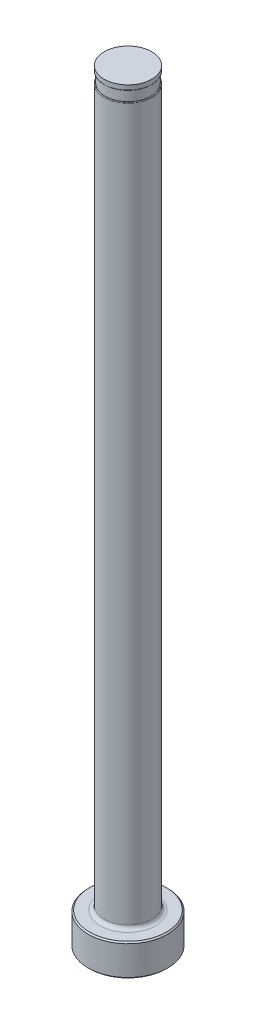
ISO-10303-21;
HEADER;
FILE_DESCRIPTION(('STEP AP214'),'2;1');
FILE_NAME('part.step','',(''),(''),'','','');
FILE_SCHEMA(('AUTOMOTIVE_DESIGN { 1 0 10303 214 1 1 1 1 }'));
ENDSEC;
DATA;
#1=APPLICATION_CONTEXT('core data for automotive mechanical design processes');
#2=APPLICATION_PROTOCOL_DEFINITION('international standard','automotive_design',2000,#1);
#3=PRODUCT_CONTEXT('',#1,'mechanical');
#4=PRODUCT('Part','Part','',(#3));
#5=PRODUCT_RELATED_PRODUCT_CATEGORY('part','',(#4));
#6=PRODUCT_DEFINITION_FORMATION('','',#4);
#7=PRODUCT_DEFINITION_CONTEXT('part definition',#1,'design');
#8=PRODUCT_DEFINITION('design','',#6,#7);
#9=PRODUCT_DEFINITION_SHAPE('','',#8);
#10=(LENGTH_UNIT() NAMED_UNIT(*) SI_UNIT(.MILLI.,.METRE.));
#11=(NAMED_UNIT(*) PLANE_ANGLE_UNIT() SI_UNIT($,.RADIAN.));
#12=(NAMED_UNIT(*) SI_UNIT($,.STERADIAN.) SOLID_ANGLE_UNIT());
#13=UNCERTAINTY_MEASURE_WITH_UNIT(LENGTH_MEASURE(1.E-05),#10,'distance_accuracy_value','');
#14=(GEOMETRIC_REPRESENTATION_CONTEXT(3) GLOBAL_UNCERTAINTY_ASSIGNED_CONTEXT((#13)) GLOBAL_UNIT_ASSIGNED_CONTEXT((#10,
#11,#12)) REPRESENTATION_CONTEXT('',''));
#15=CARTESIAN_POINT('',(0.,0.,0.));
#16=DIRECTION('',(0.,0.,1.));
#17=DIRECTION('',(1.,0.,0.));
#18=AXIS2_PLACEMENT_3D('',#15,#16,#17);
#19=CARTESIAN_POINT('',(-4.76249999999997,151.384,0.));
#20=DIRECTION('',(0.,1.,0.));
#21=DIRECTION('',(0.,0.,1.));
#22=AXIS2_PLACEMENT_3D('',#19,#20,#21);
#23=PLANE('',#22);
#24=CARTESIAN_POINT('',(0.,151.384,0.));
#25=DIRECTION('',(0.,1.,0.));
#26=DIRECTION('',(0.,0.,1.));
#27=AXIS2_PLACEMENT_3D('',#24,#25,#26);
#28=CIRCLE('',#27,4.63041999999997);
#29=CARTESIAN_POINT('',(0.,151.384,4.63041999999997));
#30=VERTEX_POINT('',#29);
#31=EDGE_CURVE('E11',#30,#30,#28,.F.);
#32=ORIENTED_EDGE('',*,*,#31,.T.);
#33=EDGE_LOOP('',(#32));
#34=FACE_BOUND('',#33,.T.);
#35=CARTESIAN_POINT('',(0.,151.384,0.));
#36=DIRECTION('',(0.,1.,0.));
#37=DIRECTION('',(0.,0.,1.));
#38=AXIS2_PLACEMENT_3D('',#35,#36,#37);
#39=CIRCLE('',#38,4.55929999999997);
#40=CARTESIAN_POINT('',(0.,151.384,4.55929999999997));
#41=VERTEX_POINT('',#40);
#42=EDGE_CURVE('E78',#41,#41,#39,.T.);
#43=ORIENTED_EDGE('',*,*,#42,.T.);
#44=EDGE_LOOP('',(#43));
#45=FACE_BOUND('',#44,.T.);
#46=ADVANCED_FACE('F36',(#34,#45),#23,.F.);
#47=CARTESIAN_POINT('',(0.,259.958771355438,0.));
#48=DIRECTION('',(0.,1.,0.));
#49=DIRECTION('',(0.,0.,1.));
#50=AXIS2_PLACEMENT_3D('',#47,#48,#49);
#51=CYLINDRICAL_SURFACE('',#50,4.76249999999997);
#52=DIRECTION('',(0.,1.,0.));
#53=VECTOR('',#52,1.);
#54=CARTESIAN_POINT('',(-4.55929999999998,259.958771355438,-1.37629566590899));
#55=LINE('',#54,#53);
#56=CARTESIAN_POINT('',(-4.55929999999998,149.225,-1.37629566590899));
#57=VERTEX_POINT('',#56);
#58=CARTESIAN_POINT('',(-4.55929999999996,86.868,-1.37629566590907));
#59=VERTEX_POINT('',#58);
#60=EDGE_CURVE('E73',#57,#59,#55,.F.);
#61=ORIENTED_EDGE('',*,*,#60,.F.);
#62=CARTESIAN_POINT('',(0.,149.225,0.));
#63=DIRECTION('',(0.,-1.,0.));
#64=DIRECTION('',(0.,0.,-1.));
#65=AXIS2_PLACEMENT_3D('',#62,#63,#64);
#66=CIRCLE('',#65,4.76249999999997);
#67=CARTESIAN_POINT('',(-4.55929999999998,149.225,1.37629566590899));
#68=VERTEX_POINT('',#67);
#69=EDGE_CURVE('E51',#57,#68,#66,.T.);
#70=ORIENTED_EDGE('',*,*,#69,.T.);
#71=DIRECTION('',(0.,1.,0.));
#72=VECTOR('',#71,1.);
#73=CARTESIAN_POINT('',(-4.55929999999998,259.958771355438,1.37629566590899));
#74=LINE('',#73,#72);
#75=CARTESIAN_POINT('',(-4.55929999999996,86.868,1.37629566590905));
#76=VERTEX_POINT('',#75);
#77=EDGE_CURVE('E84',#76,#68,#74,.T.);
#78=ORIENTED_EDGE('',*,*,#77,.F.);
#79=CARTESIAN_POINT('',(-4.55929999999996,86.868,-1.37629566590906));
#80=CARTESIAN_POINT('',(-4.55929737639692,86.8392402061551,-1.37629775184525));
#81=CARTESIAN_POINT('',(-4.55969127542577,86.8104975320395,-1.37500007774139));
#82=CARTESIAN_POINT('',(-4.56124470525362,86.7532773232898,-1.36984087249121));
#83=CARTESIAN_POINT('',(-4.5624038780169,86.7247996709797,-1.36598054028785));
#84=CARTESIAN_POINT('',(-4.56696801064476,86.6404539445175,-1.35067685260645));
#85=CARTESIAN_POINT('',(-4.5714603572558,86.5852762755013,-1.33550964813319));
#86=CARTESIAN_POINT('',(-4.58280020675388,86.4786988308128,-1.29605614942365));
#87=CARTESIAN_POINT('',(-4.58964466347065,86.4272942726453,-1.27178164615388));
#88=CARTESIAN_POINT('',(-4.60493832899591,86.3293127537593,-1.21523837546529));
#89=CARTESIAN_POINT('',(-4.61338924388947,86.2827410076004,-1.18296109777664));
#90=CARTESIAN_POINT('',(-4.63119432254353,86.1946407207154,-1.11122717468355));
#91=CARTESIAN_POINT('',(-4.64055936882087,86.1531909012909,-1.07167734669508));
#92=CARTESIAN_POINT('',(-4.65929799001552,86.0764511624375,-0.987030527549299));
#93=CARTESIAN_POINT('',(-4.66867156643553,86.0411627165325,-0.941932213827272));
#94=CARTESIAN_POINT('',(-4.68829944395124,85.9713161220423,-0.839298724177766));
#95=CARTESIAN_POINT('',(-4.69843056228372,85.9379130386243,-0.780955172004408));
#96=CARTESIAN_POINT('',(-4.71694909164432,85.8794876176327,-0.659965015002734));
#97=CARTESIAN_POINT('',(-4.72533534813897,85.8544708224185,-0.597315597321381));
#98=CARTESIAN_POINT('',(-4.74110178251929,85.8087147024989,-0.457354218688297));
#99=CARTESIAN_POINT('',(-4.74801655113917,85.7895974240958,-0.379457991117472));
#100=CARTESIAN_POINT('',(-4.75800499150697,85.7623334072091,-0.221524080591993));
#101=CARTESIAN_POINT('',(-4.76107621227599,85.754193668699,-0.141485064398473));
#102=CARTESIAN_POINT('',(-4.76327668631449,85.7483271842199,0.0299431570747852));
#103=CARTESIAN_POINT('',(-4.76181415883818,85.7521641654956,0.121398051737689));
#104=CARTESIAN_POINT('',(-4.75374911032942,85.7738915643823,0.302489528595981));
#105=CARTESIAN_POINT('',(-4.74714208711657,85.7917942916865,0.392124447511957));
#106=CARTESIAN_POINT('',(-4.72930079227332,85.8426459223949,0.568426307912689));
#107=CARTESIAN_POINT('',(-4.71798291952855,85.8758679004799,0.655007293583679));
#108=CARTESIAN_POINT('',(-4.69215822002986,85.9581393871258,0.819736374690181));
#109=CARTESIAN_POINT('',(-4.67765906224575,86.0071509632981,0.897904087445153));
#110=CARTESIAN_POINT('',(-4.65260917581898,86.1028873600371,1.01840460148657));
#111=CARTESIAN_POINT('',(-4.642278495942,86.1453315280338,1.06420330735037));
#112=CARTESIAN_POINT('',(-4.62221244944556,86.2373278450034,1.14822353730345));
#113=CARTESIAN_POINT('',(-4.61247679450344,86.2868765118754,1.18644875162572));
#114=CARTESIAN_POINT('',(-4.59462030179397,86.3926759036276,1.2538357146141));
#115=CARTESIAN_POINT('',(-4.58651300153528,86.4489770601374,1.28292253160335));
#116=CARTESIAN_POINT('',(-4.57311393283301,86.566357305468,1.3299034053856));
#117=CARTESIAN_POINT('',(-4.56781667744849,86.627426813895,1.34781928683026));
#118=CARTESIAN_POINT('',(-4.56265822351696,86.7190432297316,1.36513201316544));
#119=CARTESIAN_POINT('',(-4.5614036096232,86.7486738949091,1.36931216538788));
#120=CARTESIAN_POINT('',(-4.55972347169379,86.8081961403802,1.37489368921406));
#121=CARTESIAN_POINT('',(-4.55929732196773,86.838087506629,1.37629715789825));
#122=CARTESIAN_POINT('',(-4.55929999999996,86.868,1.37629566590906));
#123=B_SPLINE_CURVE_WITH_KNOTS('',3,(#79,#80,#81,#82,#83,#84,#85,#86,#87,#88,#89,#90,#91,#92,
#93,#94,#95,#96,#97,#98,#99,#100,#101,#102,#103,#104,#105,#106,#107,#108,#109,#110,#111,#112,
#113,#114,#115,#116,#117,#118,#119,#120,#121,#122),.UNSPECIFIED.,.F.,.F.,(4,2,2,2,2,2,2,2,2,2,2,
2,2,2,2,2,2,2,2,2,2,4),(0.,0.086214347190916,0.172388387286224,0.343564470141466,
0.514519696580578,0.685657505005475,0.859163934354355,1.03271180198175,1.23591349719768,
1.43924922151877,1.67981780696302,1.92053972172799,2.1939427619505,2.4675853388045,
2.74630643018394,3.02436286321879,3.21350217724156,3.40254910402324,3.59310796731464,
3.78329335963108,3.87302183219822,3.9626825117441),.UNSPECIFIED.);
#124=EDGE_CURVE('E81',#59,#76,#123,.T.);
#125=ORIENTED_EDGE('',*,*,#124,.F.);
#126=EDGE_LOOP('',(#61,#70,#78,#125));
#127=FACE_BOUND('',#126,.T.);
#128=CARTESIAN_POINT('',(0.,7.11200000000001,0.));
#129=DIRECTION('',(0.,1.,0.));
#130=DIRECTION('',(0.,0.,1.));
#131=AXIS2_PLACEMENT_3D('',#128,#129,#130);
#132=CIRCLE('',#131,4.76249999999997);
#133=CARTESIAN_POINT('',(0.,7.11200000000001,4.76249999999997));
#134=VERTEX_POINT('',#133);
#135=EDGE_CURVE('E116',#134,#134,#132,.T.);
#136=ORIENTED_EDGE('',*,*,#135,.T.);
#137=EDGE_LOOP('',(#136));
#138=FACE_BOUND('',#137,.T.);
#139=ADVANCED_FACE('F82',(#127,#138),#51,.T.);
#140=CARTESIAN_POINT('',(0.,0.,0.));
#141=DIRECTION('',(0.,-1.,0.));
#142=DIRECTION('',(0.,0.,-1.));
#143=AXIS2_PLACEMENT_3D('',#140,#141,#142);
#144=PLANE('',#143);
#145=CARTESIAN_POINT('',(0.,0.,0.));
#146=DIRECTION('',(0.,-1.,0.));
#147=DIRECTION('',(0.,0.,-1.));
#148=AXIS2_PLACEMENT_3D('',#145,#146,#147);
#149=CIRCLE('',#148,7.68349999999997);
#150=CARTESIAN_POINT('',(0.,0.,-7.68349999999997));
#151=VERTEX_POINT('',#150);
#152=EDGE_CURVE('E113',#151,#151,#149,.T.);
#153=ORIENTED_EDGE('',*,*,#152,.T.);
#154=EDGE_LOOP('',(#153));
#155=FACE_BOUND('',#154,.T.);
#156=ADVANCED_FACE('F192',(#155),#144,.T.);
#157=CARTESIAN_POINT('',(0.,259.958771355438,0.));
#158=DIRECTION('',(0.,1.,0.));
#159=DIRECTION('',(0.,0.,1.));
#160=AXIS2_PLACEMENT_3D('',#157,#158,#159);
#161=CYLINDRICAL_SURFACE('',#160,7.93749999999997);
#162=CARTESIAN_POINT('',(0.,6.09600000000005,0.));
#163=DIRECTION('',(0.,1.,0.));
#164=DIRECTION('',(0.,0.,1.));
#165=AXIS2_PLACEMENT_3D('',#162,#163,#164);
#166=CIRCLE('',#165,7.93749999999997);
#167=CARTESIAN_POINT('',(0.,6.09600000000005,7.93749999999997));
#168=VERTEX_POINT('',#167);
#169=EDGE_CURVE('E110',#168,#168,#166,.F.);
#170=ORIENTED_EDGE('',*,*,#169,.T.);
#171=EDGE_LOOP('',(#170));
#172=FACE_BOUND('',#171,.T.);
#173=CARTESIAN_POINT('',(0.,0.253999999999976,0.));
#174=DIRECTION('',(0.,-1.,0.));
#175=DIRECTION('',(0.,0.,-1.));
#176=AXIS2_PLACEMENT_3D('',#173,#174,#175);
#177=CIRCLE('',#176,7.93749999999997);
#178=CARTESIAN_POINT('',(0.,0.253999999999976,-7.93749999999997));
#179=VERTEX_POINT('',#178);
#180=EDGE_CURVE('E107',#179,#179,#177,.F.);
#181=ORIENTED_EDGE('',*,*,#180,.T.);
#182=EDGE_LOOP('',(#181));
#183=FACE_BOUND('',#182,.T.);
#184=ADVANCED_FACE('F195',(#172,#183),#161,.T.);
#185=CARTESIAN_POINT('',(-7.93749999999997,6.35,0.));
#186=DIRECTION('',(0.,1.,0.));
#187=DIRECTION('',(0.,0.,1.));
#188=AXIS2_PLACEMENT_3D('',#185,#186,#187);
#189=PLANE('',#188);
#190=CARTESIAN_POINT('',(0.,6.35,0.));
#191=DIRECTION('',(0.,1.,0.));
#192=DIRECTION('',(0.,0.,1.));
#193=AXIS2_PLACEMENT_3D('',#190,#191,#192);
#194=CIRCLE('',#193,5.52449999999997);
#195=CARTESIAN_POINT('',(0.,6.35,5.52449999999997));
#196=VERTEX_POINT('',#195);
#197=EDGE_CURVE('E87',#196,#196,#194,.F.);
#198=ORIENTED_EDGE('',*,*,#197,.T.);
#199=EDGE_LOOP('',(#198));
#200=FACE_BOUND('',#199,.T.);
#201=CARTESIAN_POINT('',(0.,6.35,0.));
#202=DIRECTION('',(0.,1.,0.));
#203=DIRECTION('',(0.,0.,1.));
#204=AXIS2_PLACEMENT_3D('',#201,#202,#203);
#205=CIRCLE('',#204,7.68350000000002);
#206=CARTESIAN_POINT('',(0.,6.35,7.68350000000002));
#207=VERTEX_POINT('',#206);
#208=EDGE_CURVE('E104',#207,#207,#205,.T.);
#209=ORIENTED_EDGE('',*,*,#208,.T.);
#210=EDGE_LOOP('',(#209));
#211=FACE_BOUND('',#210,.T.);
#212=ADVANCED_FACE('F190',(#200,#211),#189,.T.);
#213=CARTESIAN_POINT('',(0.,6.35000000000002,0.));
#214=DIRECTION('',(0.,-1.,0.));
#215=DIRECTION('',(0.,0.,-1.));
#216=AXIS2_PLACEMENT_3D('',#213,#214,#215);
#217=CONICAL_SURFACE('',#216,7.6835,0.785398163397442);
#218=ORIENTED_EDGE('',*,*,#169,.F.);
#219=EDGE_LOOP('',(#218));
#220=FACE_BOUND('',#219,.T.);
#221=ORIENTED_EDGE('',*,*,#208,.F.);
#222=EDGE_LOOP('',(#221));
#223=FACE_BOUND('',#222,.T.);
#224=ADVANCED_FACE('F186',(#220,#223),#217,.T.);
#225=CARTESIAN_POINT('',(0.,0.253999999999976,0.));
#226=DIRECTION('',(0.,1.,0.));
#227=DIRECTION('',(0.,0.,1.));
#228=AXIS2_PLACEMENT_3D('',#225,#226,#227);
#229=CONICAL_SURFACE('',#228,7.93749999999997,0.785398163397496);
#230=ORIENTED_EDGE('',*,*,#152,.F.);
#231=EDGE_LOOP('',(#230));
#232=FACE_BOUND('',#231,.T.);
#233=ORIENTED_EDGE('',*,*,#180,.F.);
#234=EDGE_LOOP('',(#233));
#235=FACE_BOUND('',#234,.T.);
#236=ADVANCED_FACE('F182',(#232,#235),#229,.T.);
#237=CARTESIAN_POINT('',(0.,7.11200000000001,0.));
#238=DIRECTION('',(0.,1.,0.));
#239=DIRECTION('',(0.,0.,1.));
#240=AXIS2_PLACEMENT_3D('',#237,#238,#239);
#241=TOROIDAL_SURFACE('',#240,5.52449999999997,0.762);
#242=ORIENTED_EDGE('',*,*,#197,.F.);
#243=EDGE_LOOP('',(#242));
#244=FACE_BOUND('',#243,.T.);
#245=ORIENTED_EDGE('',*,*,#135,.F.);
#246=EDGE_LOOP('',(#245));
#247=FACE_BOUND('',#246,.T.);
#248=ADVANCED_FACE('F147',(#244,#247),#241,.F.);
#249=CARTESIAN_POINT('',(-4.76249999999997,149.352,0.));
#250=DIRECTION('',(0.,-1.,0.));
#251=DIRECTION('',(0.,0.,-1.));
#252=AXIS2_PLACEMENT_3D('',#249,#250,#251);
#253=PLANE('',#252);
#254=DIRECTION('',(0.,0.,1.));
#255=VECTOR('',#254,1.);
#256=CARTESIAN_POINT('',(-4.55929999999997,149.352,0.));
#257=LINE('',#256,#255);
#258=CARTESIAN_POINT('',(-4.55929999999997,149.352,0.));
#259=VERTEX_POINT('',#258);
#260=CARTESIAN_POINT('',(-4.55929999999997,149.352,0.837044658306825));
#261=VERTEX_POINT('',#260);
#262=EDGE_CURVE('E90',#259,#261,#257,.T.);
#263=ORIENTED_EDGE('',*,*,#262,.T.);
#264=CARTESIAN_POINT('',(0.,149.352,0.));
#265=DIRECTION('',(0.,-1.,0.));
#266=DIRECTION('',(0.,0.,-1.));
#267=AXIS2_PLACEMENT_3D('',#264,#265,#266);
#268=CIRCLE('',#267,4.63549999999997);
#269=CARTESIAN_POINT('',(-4.55929999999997,149.352,-0.837044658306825));
#270=VERTEX_POINT('',#269);
#271=EDGE_CURVE('E86',#261,#270,#268,.F.);
#272=ORIENTED_EDGE('',*,*,#271,.T.);
#273=EDGE_CURVE('E79',#270,#259,#257,.T.);
#274=ORIENTED_EDGE('',*,*,#273,.T.);
#275=CARTESIAN_POINT('',(0.,149.352,0.));
#276=DIRECTION('',(0.,1.,0.));
#277=DIRECTION('',(0.,0.,1.));
#278=AXIS2_PLACEMENT_3D('',#275,#276,#277);
#279=CIRCLE('',#278,4.55929999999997);
#280=EDGE_CURVE('E101',#259,#259,#279,.T.);
#281=ORIENTED_EDGE('',*,*,#280,.F.);
#282=EDGE_LOOP('',(#263,#272,#274,#281));
#283=FACE_BOUND('',#282,.T.);
#284=ADVANCED_FACE('F144',(#283),#253,.F.);
#285=CARTESIAN_POINT('',(0.,153.448281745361,0.));
#286=DIRECTION('',(0.,1.,0.));
#287=DIRECTION('',(0.,0.,1.));
#288=AXIS2_PLACEMENT_3D('',#285,#286,#287);
#289=CYLINDRICAL_SURFACE('',#288,4.55929999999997);
#290=ORIENTED_EDGE('',*,*,#42,.F.);
#291=EDGE_LOOP('',(#290));
#292=FACE_BOUND('',#291,.T.);
#293=ORIENTED_EDGE('',*,*,#280,.T.);
#294=EDGE_LOOP('',(#293));
#295=FACE_BOUND('',#294,.T.);
#296=ADVANCED_FACE('F141',(#292,#295),#289,.T.);
#297=CARTESIAN_POINT('',(-4.55929999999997,150.368,-7.93749999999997));
#298=DIRECTION('',(1.,0.,0.));
#299=DIRECTION('',(0.,1.,0.));
#300=AXIS2_PLACEMENT_3D('',#297,#298,#299);
#301=PLANE('',#300);
#302=ORIENTED_EDGE('',*,*,#273,.F.);
#303=CARTESIAN_POINT('',(-4.55929999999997,149.352,-0.837044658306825));
#304=CARTESIAN_POINT('',(-4.55929999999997,149.351996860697,-0.858041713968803));
#305=CARTESIAN_POINT('',(-4.55929999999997,149.351829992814,-0.879040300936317));
#306=CARTESIAN_POINT('',(-4.55929999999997,149.351073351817,-0.921044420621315));
#307=CARTESIAN_POINT('',(-4.55929999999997,149.350483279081,-0.942049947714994));
#308=CARTESIAN_POINT('',(-4.55929999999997,149.348769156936,-0.984421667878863));
#309=CARTESIAN_POINT('',(-4.55929999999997,149.347635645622,-1.00578751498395));
#310=CARTESIAN_POINT('',(-4.55929999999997,149.344687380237,-1.04846310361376));
#311=CARTESIAN_POINT('',(-4.55929999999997,149.342872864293,-1.06977286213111));
#312=CARTESIAN_POINT('',(-4.55929999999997,149.337360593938,-1.12201635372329));
#313=CARTESIAN_POINT('',(-4.55929999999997,149.333181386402,-1.15290757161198));
#314=CARTESIAN_POINT('',(-4.55929999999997,149.324757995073,-1.19875333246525));
#315=CARTESIAN_POINT('',(-4.55929999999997,149.321604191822,-1.21390713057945));
#316=CARTESIAN_POINT('',(-4.55929999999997,149.31432624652,-1.24397628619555));
#317=CARTESIAN_POINT('',(-4.55929999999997,149.310203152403,-1.25889188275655));
#318=CARTESIAN_POINT('',(-4.55929999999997,149.303136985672,-1.28034672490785));
#319=CARTESIAN_POINT('',(-4.55929999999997,149.300754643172,-1.287070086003));
#320=CARTESIAN_POINT('',(-4.55929999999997,149.295598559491,-1.30038917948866));
#321=CARTESIAN_POINT('',(-4.55929999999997,149.292823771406,-1.30698451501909));
#322=CARTESIAN_POINT('',(-4.55929999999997,149.286425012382,-1.32070015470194));
#323=CARTESIAN_POINT('',(-4.55929999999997,149.282739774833,-1.32779211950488));
#324=CARTESIAN_POINT('',(-4.55929999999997,149.274505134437,-1.34145187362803));
#325=CARTESIAN_POINT('',(-4.55929999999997,149.269959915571,-1.34802199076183));
#326=CARTESIAN_POINT('',(-4.55929999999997,149.262707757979,-1.3564128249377));
#327=CARTESIAN_POINT('',(-4.55929999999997,149.260550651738,-1.35870356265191));
#328=CARTESIAN_POINT('',(-4.55929999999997,149.255986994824,-1.36303580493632));
#329=CARTESIAN_POINT('',(-4.55929999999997,149.253580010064,-1.36507686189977));
#330=CARTESIAN_POINT('',(-4.55929999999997,149.248447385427,-1.36882028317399));
#331=CARTESIAN_POINT('',(-4.55929999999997,149.24571711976,-1.37051646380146));
#332=CARTESIAN_POINT('',(-4.55929999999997,149.239982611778,-1.373337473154));
#333=CARTESIAN_POINT('',(-4.55929999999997,149.236980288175,-1.37446598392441));
#334=CARTESIAN_POINT('',(-4.55929999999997,149.232439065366,-1.37556999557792));
#335=CARTESIAN_POINT('',(-4.55929999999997,149.230969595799,-1.3758395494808));
#336=CARTESIAN_POINT('',(-4.55929999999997,149.228000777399,-1.37620343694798));
#337=CARTESIAN_POINT('',(-4.55929999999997,149.226501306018,-1.3762967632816));
#338=CARTESIAN_POINT('',(-4.55929999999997,149.225,-1.37629566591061));
#339=B_SPLINE_CURVE_WITH_KNOTS('',3,(#303,#304,#305,#306,#307,#308,#309,#310,#311,#312,#313,
#314,#315,#316,#317,#318,#319,#320,#321,#322,#323,#324,#325,#326,#327,#328,#329,#330,#331,#332,
#333,#334,#335,#336,#337,#338),.UNSPECIFIED.,.F.,.F.,(4,2,2,2,2,2,2,2,2,2,2,2,2,2,2,2,2,4),(0.,
0.062992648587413,0.126029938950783,0.190207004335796,0.254361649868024,0.347770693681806,
0.394187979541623,0.440555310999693,0.461946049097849,0.483394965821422,0.50734235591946,
0.531176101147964,0.540601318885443,0.550043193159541,0.559641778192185,0.569177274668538,
0.573649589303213,0.578147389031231),.UNSPECIFIED.);
#340=EDGE_CURVE('E59',#270,#57,#339,.T.);
#341=ORIENTED_EDGE('',*,*,#340,.T.);
#342=ORIENTED_EDGE('',*,*,#60,.T.);
#343=DIRECTION('',(0.,0.,1.));
#344=VECTOR('',#343,1.);
#345=CARTESIAN_POINT('',(-4.55929999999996,86.868,-7.93749999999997));
#346=LINE('',#345,#344);
#347=EDGE_CURVE('E77',#59,#76,#346,.T.);
#348=ORIENTED_EDGE('',*,*,#347,.T.);
#349=ORIENTED_EDGE('',*,*,#77,.T.);
#350=CARTESIAN_POINT('',(-4.55929999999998,149.225,1.37629566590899));
#351=CARTESIAN_POINT('',(-4.55929999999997,149.227444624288,1.3763038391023));
#352=CARTESIAN_POINT('',(-4.55929999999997,149.229877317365,1.37605183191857));
#353=CARTESIAN_POINT('',(-4.55929999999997,149.234619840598,1.37510642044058));
#354=CARTESIAN_POINT('',(-4.55929999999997,149.236930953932,1.37441958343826));
#355=CARTESIAN_POINT('',(-4.55929999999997,149.241943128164,1.37247105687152));
#356=CARTESIAN_POINT('',(-4.55929999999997,149.244605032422,1.3711110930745));
#357=CARTESIAN_POINT('',(-4.55929999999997,149.249689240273,1.36798215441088));
#358=CARTESIAN_POINT('',(-4.55929999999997,149.252109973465,1.36621072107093));
#359=CARTESIAN_POINT('',(-4.55929999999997,149.258401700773,1.36098866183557));
#360=CARTESIAN_POINT('',(-4.55929999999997,149.2620371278,1.35725807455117));
#361=CARTESIAN_POINT('',(-4.55929999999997,149.268750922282,1.34933701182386));
#362=CARTESIAN_POINT('',(-4.55929999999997,149.271828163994,1.34514563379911));
#363=CARTESIAN_POINT('',(-4.55929999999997,149.283141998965,1.3281317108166));
#364=CARTESIAN_POINT('',(-4.55929999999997,149.289833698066,1.31430846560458));
#365=CARTESIAN_POINT('',(-4.55929999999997,149.301426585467,1.28593719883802));
#366=CARTESIAN_POINT('',(-4.55929999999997,149.306315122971,1.27138484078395));
#367=CARTESIAN_POINT('',(-4.55929999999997,149.314580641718,1.24300288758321));
#368=CARTESIAN_POINT('',(-4.55929999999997,149.318042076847,1.22919836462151));
#369=CARTESIAN_POINT('',(-4.55929999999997,149.324216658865,1.20142059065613));
#370=CARTESIAN_POINT('',(-4.55929999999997,149.326929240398,1.18744722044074));
#371=CARTESIAN_POINT('',(-4.55929999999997,149.334216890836,1.14532367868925));
#372=CARTESIAN_POINT('',(-4.55929999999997,149.33792779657,1.11702450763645));
#373=CARTESIAN_POINT('',(-4.55929999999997,149.343831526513,1.06027711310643));
#374=CARTESIAN_POINT('',(-4.55929999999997,149.346023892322,1.031828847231));
#375=CARTESIAN_POINT('',(-4.55929999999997,149.349305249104,0.974900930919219));
#376=CARTESIAN_POINT('',(-4.55929999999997,149.350395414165,0.946421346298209));
#377=CARTESIAN_POINT('',(-4.55929999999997,149.351399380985,0.904435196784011));
#378=CARTESIAN_POINT('',(-4.55929999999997,149.351630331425,0.890934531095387));
#379=CARTESIAN_POINT('',(-4.55929999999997,149.351930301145,0.863970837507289));
#380=CARTESIAN_POINT('',(-4.55929999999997,149.351999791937,0.85050781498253));
#381=CARTESIAN_POINT('',(-4.55929999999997,149.352,0.837044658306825));
#382=B_SPLINE_CURVE_WITH_KNOTS('',3,(#350,#351,#352,#353,#354,#355,#356,#357,#358,#359,#360,
#361,#362,#363,#364,#365,#366,#367,#368,#369,#370,#371,#372,#373,#374,#375,#376,#377,#378,#379,
#380,#381),.UNSPECIFIED.,.F.,.F.,(4,2,2,2,2,2,2,2,2,2,2,2,2,2,2,4),(0.,0.00730179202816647,
0.0144958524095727,0.0234127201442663,0.0323843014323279,0.0479233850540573,0.0634934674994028,
0.109206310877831,0.155234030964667,0.1978924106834,0.240582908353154,0.326131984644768,
0.411706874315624,0.497190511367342,0.537697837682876,0.578086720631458),.UNSPECIFIED.);
#383=EDGE_CURVE('E172',#68,#261,#382,.T.);
#384=ORIENTED_EDGE('',*,*,#383,.T.);
#385=ORIENTED_EDGE('',*,*,#262,.F.);
#386=EDGE_LOOP('',(#302,#341,#342,#348,#349,#384,#385));
#387=FACE_BOUND('',#386,.T.);
#388=ADVANCED_FACE('F75',(#387),#301,.F.);
#389=CARTESIAN_POINT('',(-7.73429999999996,86.868,-7.93749999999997));
#390=DIRECTION('',(0.,0.,1.));
#391=DIRECTION('',(1.,0.,0.));
#392=AXIS2_PLACEMENT_3D('',#389,#390,#391);
#393=CYLINDRICAL_SURFACE('',#392,3.175);
#394=ORIENTED_EDGE('',*,*,#347,.F.);
#395=ORIENTED_EDGE('',*,*,#124,.T.);
#396=EDGE_LOOP('',(#394,#395));
#397=FACE_BOUND('',#396,.T.);
#398=ADVANCED_FACE('F89',(#397),#393,.F.);
#399=CARTESIAN_POINT('',(0.,152.687735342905,0.));
#400=DIRECTION('',(0.,1.,0.));
#401=DIRECTION('',(0.,0.,1.));
#402=AXIS2_PLACEMENT_3D('',#399,#400,#401);
#403=CYLINDRICAL_SURFACE('',#402,4.75741999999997);
#404=CARTESIAN_POINT('',(0.,151.511,0.));
#405=DIRECTION('',(0.,1.,0.));
#406=DIRECTION('',(0.,0.,1.));
#407=AXIS2_PLACEMENT_3D('',#404,#405,#406);
#408=CIRCLE('',#407,4.75741999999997);
#409=CARTESIAN_POINT('',(0.,151.511,4.75741999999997));
#410=VERTEX_POINT('',#409);
#411=EDGE_CURVE('E44',#410,#410,#408,.T.);
#412=ORIENTED_EDGE('',*,*,#411,.T.);
#413=EDGE_LOOP('',(#412));
#414=FACE_BOUND('',#413,.T.);
#415=CARTESIAN_POINT('',(0.,152.4,0.));
#416=DIRECTION('',(0.,1.,0.));
#417=DIRECTION('',(0.,0.,1.));
#418=AXIS2_PLACEMENT_3D('',#415,#416,#417);
#419=CIRCLE('',#418,4.75741999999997);
#420=CARTESIAN_POINT('',(0.,152.4,4.75741999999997));
#421=VERTEX_POINT('',#420);
#422=EDGE_CURVE('E91',#421,#421,#419,.T.);
#423=ORIENTED_EDGE('',*,*,#422,.F.);
#424=EDGE_LOOP('',(#423));
#425=FACE_BOUND('',#424,.T.);
#426=ADVANCED_FACE('F135',(#414,#425),#403,.T.);
#427=CARTESIAN_POINT('',(-4.76249999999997,152.4,0.));
#428=DIRECTION('',(0.,1.,0.));
#429=DIRECTION('',(0.,0.,1.));
#430=AXIS2_PLACEMENT_3D('',#427,#428,#429);
#431=PLANE('',#430);
#432=ORIENTED_EDGE('',*,*,#422,.T.);
#433=EDGE_LOOP('',(#432));
#434=FACE_BOUND('',#433,.T.);
#435=ADVANCED_FACE('F149',(#434),#431,.T.);
#436=CARTESIAN_POINT('',(0.,149.225,0.));
#437=DIRECTION('',(0.,-1.,0.));
#438=DIRECTION('',(0.,0.,-1.));
#439=AXIS2_PLACEMENT_3D('',#436,#437,#438);
#440=TOROIDAL_SURFACE('',#439,4.63549999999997,0.127);
#441=ORIENTED_EDGE('',*,*,#383,.F.);
#442=ORIENTED_EDGE('',*,*,#69,.F.);
#443=ORIENTED_EDGE('',*,*,#340,.F.);
#444=ORIENTED_EDGE('',*,*,#271,.F.);
#445=EDGE_LOOP('',(#441,#442,#443,#444));
#446=FACE_BOUND('',#445,.T.);
#447=ADVANCED_FACE('F151',(#446),#440,.T.);
#448=CARTESIAN_POINT('',(0.,151.511,0.));
#449=DIRECTION('',(0.,1.,0.));
#450=DIRECTION('',(0.,0.,1.));
#451=AXIS2_PLACEMENT_3D('',#448,#449,#450);
#452=TOROIDAL_SURFACE('',#451,4.63041999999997,0.127);
#453=ORIENTED_EDGE('',*,*,#31,.F.);
#454=EDGE_LOOP('',(#453));
#455=FACE_BOUND('',#454,.T.);
#456=ORIENTED_EDGE('',*,*,#411,.F.);
#457=EDGE_LOOP('',(#456));
#458=FACE_BOUND('',#457,.T.);
#459=ADVANCED_FACE('F38',(#455,#458),#452,.T.);
#460=CLOSED_SHELL('',(#46,#139,#156,#184,#212,#224,#236,#248,#284,#296,#388,#398,#426,#435,#447,#459));
#461=MANIFOLD_SOLID_BREP('B2',#460);
#462=ADVANCED_BREP_SHAPE_REPRESENTATION('',(#18,#461),#14);
#463=SHAPE_DEFINITION_REPRESENTATION(#9,#462);
ENDSEC;
END-ISO-10303-21;
